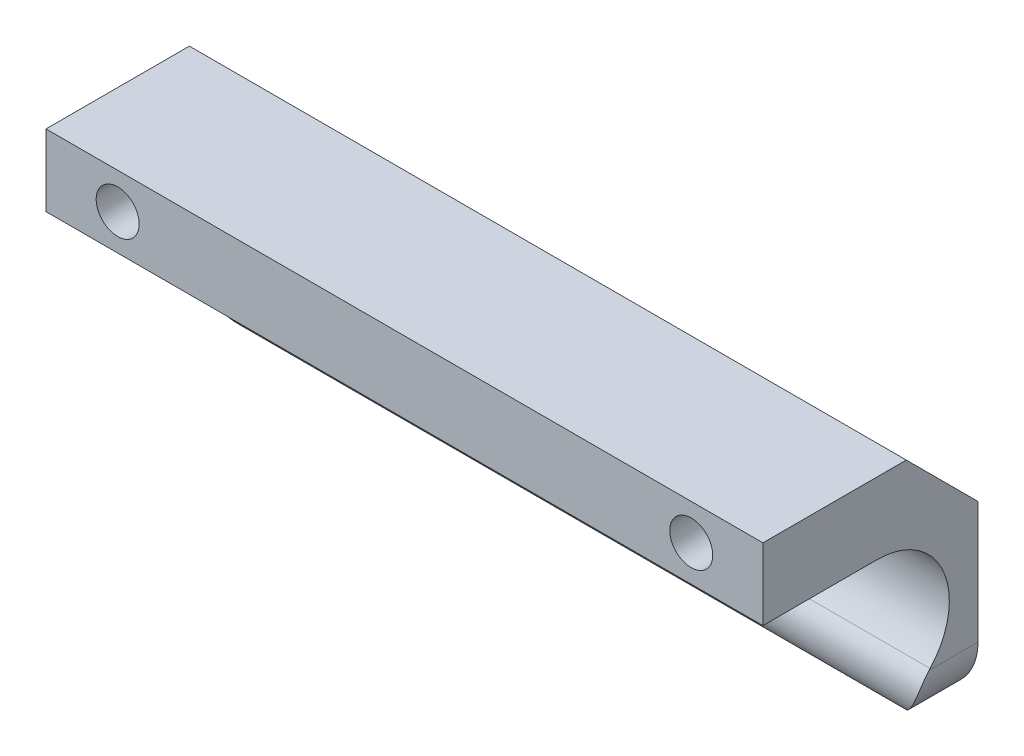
ISO-10303-21;
HEADER;
FILE_DESCRIPTION(('STEP AP214'),'2;1');
FILE_NAME('part.step','',(''),(''),'','','');
FILE_SCHEMA(('AUTOMOTIVE_DESIGN { 1 0 10303 214 1 1 1 1 }'));
ENDSEC;
DATA;
#1=APPLICATION_CONTEXT('core data for automotive mechanical design processes');
#2=APPLICATION_PROTOCOL_DEFINITION('international standard','automotive_design',2000,#1);
#3=PRODUCT_CONTEXT('',#1,'mechanical');
#4=PRODUCT('Part','Part','',(#3));
#5=PRODUCT_RELATED_PRODUCT_CATEGORY('part','',(#4));
#6=PRODUCT_DEFINITION_FORMATION('','',#4);
#7=PRODUCT_DEFINITION_CONTEXT('part definition',#1,'design');
#8=PRODUCT_DEFINITION('design','',#6,#7);
#9=PRODUCT_DEFINITION_SHAPE('','',#8);
#10=(LENGTH_UNIT() NAMED_UNIT(*) SI_UNIT(.MILLI.,.METRE.));
#11=(NAMED_UNIT(*) PLANE_ANGLE_UNIT() SI_UNIT($,.RADIAN.));
#12=(NAMED_UNIT(*) SI_UNIT($,.STERADIAN.) SOLID_ANGLE_UNIT());
#13=UNCERTAINTY_MEASURE_WITH_UNIT(LENGTH_MEASURE(1.E-05),#10,'distance_accuracy_value','');
#14=(GEOMETRIC_REPRESENTATION_CONTEXT(3) GLOBAL_UNCERTAINTY_ASSIGNED_CONTEXT((#13)) GLOBAL_UNIT_ASSIGNED_CONTEXT((#10,
#11,#12)) REPRESENTATION_CONTEXT('',''));
#15=CARTESIAN_POINT('',(0.,0.,0.));
#16=DIRECTION('',(0.,0.,1.));
#17=DIRECTION('',(1.,0.,0.));
#18=AXIS2_PLACEMENT_3D('',#15,#16,#17);
#19=CARTESIAN_POINT('',(-50.,17.5,-15.));
#20=DIRECTION('',(-1.,0.,0.));
#21=DIRECTION('',(0.,0.,1.));
#22=AXIS2_PLACEMENT_3D('',#19,#20,#21);
#23=PLANE('',#22);
#24=DIRECTION('',(0.,1.,0.));
#25=VECTOR('',#24,1.);
#26=CARTESIAN_POINT('',(-50.,-17.5,-15.));
#27=LINE('',#26,#25);
#28=CARTESIAN_POINT('',(-50.,-9.5,-15.));
#29=VERTEX_POINT('',#28);
#30=CARTESIAN_POINT('',(-50.,7.49999999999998,-15.));
#31=VERTEX_POINT('',#30);
#32=EDGE_CURVE('E202',#29,#31,#27,.T.);
#33=ORIENTED_EDGE('',*,*,#32,.F.);
#34=DIRECTION('',(0.,0.,-1.));
#35=VECTOR('',#34,1.);
#36=CARTESIAN_POINT('',(-50.,-9.5,15.));
#37=LINE('',#36,#35);
#38=CARTESIAN_POINT('',(-50.,-9.5,-8.15302564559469));
#39=VERTEX_POINT('',#38);
#40=EDGE_CURVE('E162',#39,#29,#37,.T.);
#41=ORIENTED_EDGE('',*,*,#40,.F.);
#42=CARTESIAN_POINT('',(-50.,-12.642135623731,-11.857864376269));
#43=DIRECTION('',(1.,0.,0.));
#44=DIRECTION('',(0.,0.,-1.));
#45=AXIS2_PLACEMENT_3D('',#42,#43,#44);
#46=CIRCLE('',#45,4.85786437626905);
#47=CARTESIAN_POINT('',(-50.,-9.32610593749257,-8.30782305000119));
#48=VERTEX_POINT('',#47);
#49=EDGE_CURVE('E176',#48,#39,#46,.T.);
#50=ORIENTED_EDGE('',*,*,#49,.F.);
#51=CARTESIAN_POINT('',(-50.,-2.5,-0.999999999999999));
#52=DIRECTION('',(1.,0.,0.));
#53=DIRECTION('',(0.,0.,-1.));
#54=AXIS2_PLACEMENT_3D('',#51,#52,#53);
#55=CIRCLE('',#54,10.);
#56=CARTESIAN_POINT('',(-50.,7.5,-1.));
#57=VERTEX_POINT('',#56);
#58=EDGE_CURVE('E180',#48,#57,#55,.T.);
#59=ORIENTED_EDGE('',*,*,#58,.T.);
#60=DIRECTION('',(0.,0.,1.));
#61=VECTOR('',#60,1.);
#62=CARTESIAN_POINT('',(-50.,7.5,-35.9970345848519));
#63=LINE('',#62,#61);
#64=CARTESIAN_POINT('',(-50.,7.5,15.));
#65=VERTEX_POINT('',#64);
#66=EDGE_CURVE('E185',#57,#65,#63,.T.);
#67=ORIENTED_EDGE('',*,*,#66,.T.);
#68=DIRECTION('',(0.,-1.,0.));
#69=VECTOR('',#68,1.);
#70=CARTESIAN_POINT('',(-50.,-17.5,15.));
#71=LINE('',#70,#69);
#72=CARTESIAN_POINT('',(-50.,17.5,15.));
#73=VERTEX_POINT('',#72);
#74=EDGE_CURVE('E212',#73,#65,#71,.T.);
#75=ORIENTED_EDGE('',*,*,#74,.F.);
#76=DIRECTION('',(0.,0.,1.));
#77=VECTOR('',#76,1.);
#78=CARTESIAN_POINT('',(-50.,17.5,15.));
#79=LINE('',#78,#77);
#80=CARTESIAN_POINT('',(-50.,17.5,-5.));
#81=VERTEX_POINT('',#80);
#82=EDGE_CURVE('E222',#81,#73,#79,.T.);
#83=ORIENTED_EDGE('',*,*,#82,.F.);
#84=DIRECTION('',(0.,0.707106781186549,0.707106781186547));
#85=VECTOR('',#84,1.);
#86=CARTESIAN_POINT('',(-50.,12.5,-9.99999999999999));
#87=LINE('',#86,#85);
#88=EDGE_CURVE('E235',#81,#31,#87,.F.);
#89=ORIENTED_EDGE('',*,*,#88,.T.);
#90=EDGE_LOOP('',(#33,#41,#50,#59,#67,#75,#83,#89));
#91=FACE_BOUND('',#90,.T.);
#92=ADVANCED_FACE('F37',(#91),#23,.T.);
#93=CARTESIAN_POINT('',(50.,17.5,-15.));
#94=DIRECTION('',(-1.,0.,0.));
#95=DIRECTION('',(0.,0.,1.));
#96=AXIS2_PLACEMENT_3D('',#93,#94,#95);
#97=PLANE('',#96);
#98=DIRECTION('',(0.,0.,-1.));
#99=VECTOR('',#98,1.);
#100=CARTESIAN_POINT('',(50.,-9.5,15.));
#101=LINE('',#100,#99);
#102=CARTESIAN_POINT('',(50.,-9.5,-8.15302564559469));
#103=VERTEX_POINT('',#102);
#104=CARTESIAN_POINT('',(50.,-9.5,-15.));
#105=VERTEX_POINT('',#104);
#106=EDGE_CURVE('E168',#103,#105,#101,.T.);
#107=ORIENTED_EDGE('',*,*,#106,.T.);
#108=DIRECTION('',(0.,1.,0.));
#109=VECTOR('',#108,1.);
#110=CARTESIAN_POINT('',(50.,-17.5,-15.));
#111=LINE('',#110,#109);
#112=CARTESIAN_POINT('',(50.,7.49999999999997,-15.));
#113=VERTEX_POINT('',#112);
#114=EDGE_CURVE('E208',#105,#113,#111,.T.);
#115=ORIENTED_EDGE('',*,*,#114,.T.);
#116=DIRECTION('',(0.,-0.707106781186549,-0.707106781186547));
#117=VECTOR('',#116,1.);
#118=CARTESIAN_POINT('',(50.,17.5,-5.));
#119=LINE('',#118,#117);
#120=CARTESIAN_POINT('',(50.,17.5,-5.));
#121=VERTEX_POINT('',#120);
#122=EDGE_CURVE('E243',#113,#121,#119,.F.);
#123=ORIENTED_EDGE('',*,*,#122,.T.);
#124=DIRECTION('',(0.,0.,1.));
#125=VECTOR('',#124,1.);
#126=CARTESIAN_POINT('',(50.,17.5,15.));
#127=LINE('',#126,#125);
#128=CARTESIAN_POINT('',(50.,17.5,15.));
#129=VERTEX_POINT('',#128);
#130=EDGE_CURVE('E211',#121,#129,#127,.T.);
#131=ORIENTED_EDGE('',*,*,#130,.T.);
#132=DIRECTION('',(0.,-1.,0.));
#133=VECTOR('',#132,1.);
#134=CARTESIAN_POINT('',(50.,-17.5,15.));
#135=LINE('',#134,#133);
#136=CARTESIAN_POINT('',(50.,7.5,15.));
#137=VERTEX_POINT('',#136);
#138=EDGE_CURVE('E215',#129,#137,#135,.T.);
#139=ORIENTED_EDGE('',*,*,#138,.T.);
#140=DIRECTION('',(0.,0.,1.));
#141=VECTOR('',#140,1.);
#142=CARTESIAN_POINT('',(50.,7.5,-35.9970345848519));
#143=LINE('',#142,#141);
#144=CARTESIAN_POINT('',(50.,7.5,-1.));
#145=VERTEX_POINT('',#144);
#146=EDGE_CURVE('E181',#145,#137,#143,.T.);
#147=ORIENTED_EDGE('',*,*,#146,.F.);
#148=CARTESIAN_POINT('',(50.,-2.5,-0.999999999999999));
#149=DIRECTION('',(1.,0.,0.));
#150=DIRECTION('',(0.,0.,-1.));
#151=AXIS2_PLACEMENT_3D('',#148,#149,#150);
#152=CIRCLE('',#151,10.);
#153=CARTESIAN_POINT('',(50.,-9.32610593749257,-8.30782305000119));
#154=VERTEX_POINT('',#153);
#155=EDGE_CURVE('E193',#154,#145,#152,.T.);
#156=ORIENTED_EDGE('',*,*,#155,.F.);
#157=CARTESIAN_POINT('',(50.,-12.642135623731,-11.857864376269));
#158=DIRECTION('',(1.,0.,0.));
#159=DIRECTION('',(0.,0.,-1.));
#160=AXIS2_PLACEMENT_3D('',#157,#158,#159);
#161=CIRCLE('',#160,4.85786437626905);
#162=EDGE_CURVE('E175',#154,#103,#161,.T.);
#163=ORIENTED_EDGE('',*,*,#162,.T.);
#164=EDGE_LOOP('',(#107,#115,#123,#131,#139,#147,#156,#163));
#165=FACE_BOUND('',#164,.T.);
#166=ADVANCED_FACE('F267',(#165),#97,.F.);
#167=CARTESIAN_POINT('',(50.,-17.5,-15.));
#168=DIRECTION('',(0.,0.,1.));
#169=DIRECTION('',(1.,0.,0.));
#170=AXIS2_PLACEMENT_3D('',#167,#168,#169);
#171=PLANE('',#170);
#172=DIRECTION('',(1.,0.,0.));
#173=VECTOR('',#172,1.);
#174=CARTESIAN_POINT('',(-50.,-16.3469743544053,-15.));
#175=LINE('',#174,#173);
#176=CARTESIAN_POINT('',(-46.1375043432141,-16.3469743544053,-15.));
#177=VERTEX_POINT('',#176);
#178=CARTESIAN_POINT('',(46.1375043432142,-16.3469743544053,-15.));
#179=VERTEX_POINT('',#178);
#180=EDGE_CURVE('E172',#177,#179,#175,.T.);
#181=ORIENTED_EDGE('',*,*,#180,.F.);
#182=CARTESIAN_POINT('',(-42.,-9.5,-15.));
#183=DIRECTION('',(0.,0.,1.));
#184=DIRECTION('',(-1.,0.,0.));
#185=AXIS2_PLACEMENT_3D('',#182,#183,#184);
#186=CIRCLE('',#185,8.);
#187=EDGE_CURVE('E159',#29,#177,#186,.T.);
#188=ORIENTED_EDGE('',*,*,#187,.F.);
#189=ORIENTED_EDGE('',*,*,#32,.T.);
#190=DIRECTION('',(1.,0.,0.));
#191=VECTOR('',#190,1.);
#192=CARTESIAN_POINT('',(50.,7.49999999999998,-15.));
#193=LINE('',#192,#191);
#194=EDGE_CURVE('E239',#31,#113,#193,.T.);
#195=ORIENTED_EDGE('',*,*,#194,.T.);
#196=ORIENTED_EDGE('',*,*,#114,.F.);
#197=CARTESIAN_POINT('',(42.,-9.5,-15.));
#198=DIRECTION('',(0.,0.,1.));
#199=DIRECTION('',(-1.,0.,0.));
#200=AXIS2_PLACEMENT_3D('',#197,#198,#199);
#201=CIRCLE('',#200,8.00000000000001);
#202=EDGE_CURVE('E165',#179,#105,#201,.T.);
#203=ORIENTED_EDGE('',*,*,#202,.F.);
#204=EDGE_LOOP('',(#181,#188,#189,#195,#196,#203));
#205=FACE_BOUND('',#204,.T.);
#206=ADVANCED_FACE('F314',(#205),#171,.F.);
#207=CARTESIAN_POINT('',(50.,17.5,15.));
#208=DIRECTION('',(0.,-1.,0.));
#209=DIRECTION('',(0.,0.,-1.));
#210=AXIS2_PLACEMENT_3D('',#207,#208,#209);
#211=PLANE('',#210);
#212=ORIENTED_EDGE('',*,*,#130,.F.);
#213=DIRECTION('',(-1.,0.,0.));
#214=VECTOR('',#213,1.);
#215=CARTESIAN_POINT('',(50.,17.5,-5.));
#216=LINE('',#215,#214);
#217=EDGE_CURVE('E231',#121,#81,#216,.T.);
#218=ORIENTED_EDGE('',*,*,#217,.T.);
#219=ORIENTED_EDGE('',*,*,#82,.T.);
#220=DIRECTION('',(-1.,0.,0.));
#221=VECTOR('',#220,1.);
#222=CARTESIAN_POINT('',(50.,17.5,15.));
#223=LINE('',#222,#221);
#224=EDGE_CURVE('E219',#129,#73,#223,.T.);
#225=ORIENTED_EDGE('',*,*,#224,.F.);
#226=EDGE_LOOP('',(#212,#218,#219,#225));
#227=FACE_BOUND('',#226,.T.);
#228=ADVANCED_FACE('F321',(#227),#211,.F.);
#229=CARTESIAN_POINT('',(50.,-17.5,15.));
#230=DIRECTION('',(0.,0.,-1.));
#231=DIRECTION('',(-1.,0.,0.));
#232=AXIS2_PLACEMENT_3D('',#229,#230,#231);
#233=PLANE('',#232);
#234=CARTESIAN_POINT('',(40.,12.5,15.));
#235=DIRECTION('',(0.,0.,1.));
#236=DIRECTION('',(1.,0.,0.));
#237=AXIS2_PLACEMENT_3D('',#234,#235,#236);
#238=CIRCLE('',#237,3.);
#239=CARTESIAN_POINT('',(43.,12.5,15.));
#240=VERTEX_POINT('',#239);
#241=EDGE_CURVE('E490',#240,#240,#238,.T.);
#242=ORIENTED_EDGE('',*,*,#241,.F.);
#243=EDGE_LOOP('',(#242));
#244=FACE_BOUND('',#243,.T.);
#245=CARTESIAN_POINT('',(-40.,12.5,15.));
#246=DIRECTION('',(0.,0.,1.));
#247=DIRECTION('',(1.,0.,0.));
#248=AXIS2_PLACEMENT_3D('',#245,#246,#247);
#249=CIRCLE('',#248,3.);
#250=CARTESIAN_POINT('',(-37.,12.5,15.));
#251=VERTEX_POINT('',#250);
#252=EDGE_CURVE('E134',#251,#251,#249,.T.);
#253=ORIENTED_EDGE('',*,*,#252,.F.);
#254=EDGE_LOOP('',(#253));
#255=FACE_BOUND('',#254,.T.);
#256=ORIENTED_EDGE('',*,*,#74,.T.);
#257=DIRECTION('',(1.,0.,0.));
#258=VECTOR('',#257,1.);
#259=CARTESIAN_POINT('',(-50.,7.5,15.));
#260=LINE('',#259,#258);
#261=EDGE_CURVE('E198',#65,#137,#260,.T.);
#262=ORIENTED_EDGE('',*,*,#261,.T.);
#263=ORIENTED_EDGE('',*,*,#138,.F.);
#264=ORIENTED_EDGE('',*,*,#224,.T.);
#265=EDGE_LOOP('',(#256,#262,#263,#264));
#266=FACE_BOUND('',#265,.T.);
#267=ADVANCED_FACE('F318',(#244,#255,#266),#233,.F.);
#268=CARTESIAN_POINT('',(50.,17.5,-5.));
#269=DIRECTION('',(0.,-0.707106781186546,0.707106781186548));
#270=DIRECTION('',(0.,-0.707106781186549,-0.707106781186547));
#271=AXIS2_PLACEMENT_3D('',#268,#269,#270);
#272=PLANE('',#271);
#273=ORIENTED_EDGE('',*,*,#122,.F.);
#274=ORIENTED_EDGE('',*,*,#194,.F.);
#275=ORIENTED_EDGE('',*,*,#88,.F.);
#276=ORIENTED_EDGE('',*,*,#217,.F.);
#277=EDGE_LOOP('',(#273,#274,#275,#276));
#278=FACE_BOUND('',#277,.T.);
#279=ADVANCED_FACE('F39',(#278),#272,.F.);
#280=CARTESIAN_POINT('',(-50.,-12.642135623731,-11.857864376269));
#281=DIRECTION('',(1.,0.,0.));
#282=DIRECTION('',(0.,0.,-1.));
#283=AXIS2_PLACEMENT_3D('',#280,#281,#282);
#284=CYLINDRICAL_SURFACE('',#283,4.85786437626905);
#285=CARTESIAN_POINT('',(-46.1375043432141,-16.3469743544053,-15.));
#286=CARTESIAN_POINT('',(-46.0261493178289,-16.4142592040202,-14.9206561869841));
#287=CARTESIAN_POINT('',(-45.9139235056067,-16.4783721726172,-14.8399052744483));
#288=CARTESIAN_POINT('',(-45.6879480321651,-16.6003901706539,-14.675935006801));
#289=CARTESIAN_POINT('',(-45.5741986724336,-16.65829640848,-14.5927161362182));
#290=CARTESIAN_POINT('',(-45.231107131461,-16.8228592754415,-14.3399621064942));
#291=CARTESIAN_POINT('',(-44.9997446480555,-16.9204660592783,-14.1672029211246));
#292=CARTESIAN_POINT('',(-44.5341663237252,-17.0920563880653,-13.8161969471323));
#293=CARTESIAN_POINT('',(-44.2999657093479,-17.1661334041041,-13.6379750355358));
#294=CARTESIAN_POINT('',(-43.8289391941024,-17.2919435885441,-13.2772338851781));
#295=CARTESIAN_POINT('',(-43.5921135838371,-17.3436792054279,-13.0947151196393));
#296=CARTESIAN_POINT('',(-43.1319730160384,-17.422727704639,-12.7387085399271));
#297=CARTESIAN_POINT('',(-42.9087578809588,-17.4513858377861,-12.5653856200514));
#298=CARTESIAN_POINT('',(-42.4617109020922,-17.4898128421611,-12.2176471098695));
#299=CARTESIAN_POINT('',(-42.2378795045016,-17.4995929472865,-12.0432322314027));
#300=CARTESIAN_POINT('',(-42.0094068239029,-17.4999958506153,-11.865194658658));
#301=CARTESIAN_POINT('',(-42.00470339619,-17.4999999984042,-11.8615295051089));
#302=CARTESIAN_POINT('',(-42.,-17.5,-11.857864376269));
#303=B_SPLINE_CURVE_WITH_KNOTS('',3,(#285,#286,#287,#288,#289,#290,#291,#292,#293,#294,#295,
#296,#297,#298,#299,#300,#301,#302),.UNSPECIFIED.,.F.,.F.,(4,2,2,2,2,2,2,2,4),(0.,
0.457072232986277,0.914055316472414,1.8272981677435,2.73686646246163,3.64633504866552,
4.49789854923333,5.34895514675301,5.3668436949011),.UNSPECIFIED.);
#304=CARTESIAN_POINT('',(-42.,-17.5,-11.857864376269));
#305=VERTEX_POINT('',#304);
#306=EDGE_CURVE('E11',#177,#305,#303,.T.);
#307=ORIENTED_EDGE('',*,*,#306,.F.);
#308=ORIENTED_EDGE('',*,*,#180,.T.);
#309=CARTESIAN_POINT('',(46.1375043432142,-16.3469743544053,-15.));
#310=CARTESIAN_POINT('',(46.0261493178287,-16.4142592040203,-14.920656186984));
#311=CARTESIAN_POINT('',(45.9139235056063,-16.4783721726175,-14.839905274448));
#312=CARTESIAN_POINT('',(45.6879480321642,-16.6003901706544,-14.6759350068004));
#313=CARTESIAN_POINT('',(45.5741986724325,-16.6582964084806,-14.5927161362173));
#314=CARTESIAN_POINT('',(45.2311071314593,-16.8228592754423,-14.3399621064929));
#315=CARTESIAN_POINT('',(44.9997446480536,-16.9204660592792,-14.1672029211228));
#316=CARTESIAN_POINT('',(44.534166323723,-17.092056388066,-13.8161969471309));
#317=CARTESIAN_POINT('',(44.2999657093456,-17.1661334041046,-13.6379750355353));
#318=CARTESIAN_POINT('',(43.8289391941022,-17.2919435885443,-13.2772338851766));
#319=CARTESIAN_POINT('',(43.5921135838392,-17.343679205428,-13.0947151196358));
#320=CARTESIAN_POINT('',(43.1319730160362,-17.422727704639,-12.7387085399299));
#321=CARTESIAN_POINT('',(42.9087578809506,-17.4513858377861,-12.5653856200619));
#322=CARTESIAN_POINT('',(42.4617109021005,-17.4898128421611,-12.217647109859));
#323=CARTESIAN_POINT('',(42.2378795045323,-17.4995929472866,-12.0432322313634));
#324=CARTESIAN_POINT('',(42.0094068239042,-17.4999958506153,-11.8651946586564));
#325=CARTESIAN_POINT('',(42.0047033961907,-17.4999999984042,-11.8615295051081));
#326=CARTESIAN_POINT('',(42.,-17.5,-11.857864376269));
#327=B_SPLINE_CURVE_WITH_KNOTS('',3,(#309,#310,#311,#312,#313,#314,#315,#316,#317,#318,#319,
#320,#321,#322,#323,#324,#325,#326),.UNSPECIFIED.,.F.,.F.,(4,2,2,2,2,2,2,2,4),(0.,
0.457072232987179,0.914055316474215,1.8272981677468,2.73686646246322,3.6463350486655,
4.49789854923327,5.34895514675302,5.36684369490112),.UNSPECIFIED.);
#328=CARTESIAN_POINT('',(42.,-17.5,-11.857864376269));
#329=VERTEX_POINT('',#328);
#330=EDGE_CURVE('E246',#329,#179,#327,.F.);
#331=ORIENTED_EDGE('',*,*,#330,.F.);
#332=CARTESIAN_POINT('',(50.,-9.5,-8.15302564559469));
#333=CARTESIAN_POINT('',(50.0000097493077,-9.59352523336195,-8.07368202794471));
#334=CARTESIAN_POINT('',(49.9983604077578,-9.69008993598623,-7.99789663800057));
#335=CARTESIAN_POINT('',(49.9911711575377,-9.8885985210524,-7.85388207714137));
#336=CARTESIAN_POINT('',(49.9856301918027,-9.99054385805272,-7.78565496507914));
#337=CARTESIAN_POINT('',(49.9700913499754,-10.198972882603,-7.65729543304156));
#338=CARTESIAN_POINT('',(49.9600973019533,-10.3054526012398,-7.59715611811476));
#339=CARTESIAN_POINT('',(49.9351784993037,-10.52217077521,-7.48528386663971));
#340=CARTESIAN_POINT('',(49.9202543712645,-10.6324087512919,-7.4335498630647));
#341=CARTESIAN_POINT('',(49.8850588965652,-10.8559787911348,-7.33865317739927));
#342=CARTESIAN_POINT('',(49.8647759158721,-10.9693170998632,-7.29550950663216));
#343=CARTESIAN_POINT('',(49.8186122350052,-11.1979113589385,-7.21807659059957));
#344=CARTESIAN_POINT('',(49.7927294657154,-11.3131680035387,-7.1837906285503));
#345=CARTESIAN_POINT('',(49.735281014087,-11.5444077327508,-7.12414698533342));
#346=CARTESIAN_POINT('',(49.703722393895,-11.6603897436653,-7.09877832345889));
#347=CARTESIAN_POINT('',(49.6348944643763,-11.8922834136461,-7.05677505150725));
#348=CARTESIAN_POINT('',(49.5976230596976,-12.0081950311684,-7.04014365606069));
#349=CARTESIAN_POINT('',(49.51821752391,-12.2369330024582,-7.01558661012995));
#350=CARTESIAN_POINT('',(49.4761815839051,-12.34977757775,-7.00751149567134));
#351=CARTESIAN_POINT('',(49.386927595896,-12.5737336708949,-6.99918860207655));
#352=CARTESIAN_POINT('',(49.3397075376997,-12.6848444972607,-6.99894387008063));
#353=CARTESIAN_POINT('',(49.2403552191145,-12.9046752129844,-7.00585245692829));
#354=CARTESIAN_POINT('',(49.188220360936,-13.0133938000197,-7.01300970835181));
#355=CARTESIAN_POINT('',(49.0793844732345,-13.2278389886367,-7.03423365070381));
#356=CARTESIAN_POINT('',(49.0226824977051,-13.3335649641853,-7.04830177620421));
#357=CARTESIAN_POINT('',(48.8837240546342,-13.5793186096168,-7.08909377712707));
#358=CARTESIAN_POINT('',(48.7996590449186,-13.7178767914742,-7.11855734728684));
#359=CARTESIAN_POINT('',(48.6246176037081,-13.9877993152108,-7.1880171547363));
#360=CARTESIAN_POINT('',(48.5336391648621,-14.1191615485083,-7.22801645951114));
#361=CARTESIAN_POINT('',(48.34555598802,-14.3743273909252,-7.31730842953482));
#362=CARTESIAN_POINT('',(48.2484445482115,-14.4981224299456,-7.36661138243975));
#363=CARTESIAN_POINT('',(48.0489770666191,-14.7377664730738,-7.47330173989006));
#364=CARTESIAN_POINT('',(47.9466195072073,-14.8536131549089,-7.53069149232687));
#365=CARTESIAN_POINT('',(47.6981722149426,-15.1191765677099,-7.67530997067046));
#366=CARTESIAN_POINT('',(47.5500680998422,-15.2653178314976,-7.76566141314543));
#367=CARTESIAN_POINT('',(47.2469870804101,-15.5424592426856,-7.95717871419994));
#368=CARTESIAN_POINT('',(47.0920104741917,-15.673460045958,-8.05834410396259));
#369=CARTESIAN_POINT('',(46.7761676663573,-15.920945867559,-8.26972021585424));
#370=CARTESIAN_POINT('',(46.6152908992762,-16.0374030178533,-8.37994765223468));
#371=CARTESIAN_POINT('',(46.2890167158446,-16.2559526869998,-8.60762234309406));
#372=CARTESIAN_POINT('',(46.1236192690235,-16.3580451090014,-8.72506964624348));
#373=CARTESIAN_POINT('',(45.7251962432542,-16.5847491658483,-9.01187498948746));
#374=CARTESIAN_POINT('',(45.4904917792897,-16.7030468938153,-9.18391192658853));
#375=CARTESIAN_POINT('',(45.0159252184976,-16.9142900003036,-9.53627860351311));
#376=CARTESIAN_POINT('',(44.7760611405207,-17.007225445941,-9.71661156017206));
#377=CARTESIAN_POINT('',(44.2929259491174,-17.1685898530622,-10.0830184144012));
#378=CARTESIAN_POINT('',(44.0496584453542,-17.2370429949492,-10.2690864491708));
#379=CARTESIAN_POINT('',(43.5608069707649,-17.3502768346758,-10.6450941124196));
#380=CARTESIAN_POINT('',(43.3152234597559,-17.395062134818,-10.8350329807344));
#381=CARTESIAN_POINT('',(42.7182200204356,-17.4755446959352,-11.2982018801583));
#382=CARTESIAN_POINT('',(42.3660106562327,-17.4993671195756,-11.5726501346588));
#383=CARTESIAN_POINT('',(42.0094067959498,-17.4999958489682,-11.8505341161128));
#384=CARTESIAN_POINT('',(42.0047033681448,-17.4999999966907,-11.854199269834));
#385=CARTESIAN_POINT('',(42.,-17.5,-11.857864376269));
#386=B_SPLINE_CURVE_WITH_KNOTS('',3,(#332,#333,#334,#335,#336,#337,#338,#339,#340,#341,#342,
#343,#344,#345,#346,#347,#348,#349,#350,#351,#352,#353,#354,#355,#356,#357,#358,#359,#360,#361,
#362,#363,#364,#365,#366,#367,#368,#369,#370,#371,#372,#373,#374,#375,#376,#377,#378,#379,#380,
#381,#382,#383,#384,#385),.UNSPECIFIED.,.F.,.F.,(4,2,2,2,2,2,2,2,2,2,2,2,2,2,2,2,2,2,2,2,2,2,2,
2,2,2,4),(0.,0.367866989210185,0.735833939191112,1.10348517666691,1.47108970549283,
1.83949895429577,2.20804456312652,2.57613474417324,2.94436025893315,3.30604174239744,
3.66786397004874,4.02987852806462,4.391968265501,4.88540779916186,5.37899115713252,
5.87312353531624,6.36739967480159,7.04689686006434,7.72636459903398,8.4071149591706,
9.08786990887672,10.0289002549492,10.9702986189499,11.9107646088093,12.8510476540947,
14.189414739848,14.2073032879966),.UNSPECIFIED.);
#387=EDGE_CURVE('E64',#103,#329,#386,.T.);
#388=ORIENTED_EDGE('',*,*,#387,.F.);
#389=ORIENTED_EDGE('',*,*,#162,.F.);
#390=DIRECTION('',(1.,0.,0.));
#391=VECTOR('',#390,1.);
#392=CARTESIAN_POINT('',(-50.,-9.32610593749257,-8.30782305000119));
#393=LINE('',#392,#391);
#394=EDGE_CURVE('E189',#48,#154,#393,.T.);
#395=ORIENTED_EDGE('',*,*,#394,.F.);
#396=ORIENTED_EDGE('',*,*,#49,.T.);
#397=CARTESIAN_POINT('',(-50.,-9.5,-8.15302564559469));
#398=CARTESIAN_POINT('',(-50.0000097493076,-9.59352523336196,-8.07368202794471));
#399=CARTESIAN_POINT('',(-49.9983604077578,-9.69008993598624,-7.99789663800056));
#400=CARTESIAN_POINT('',(-49.9911711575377,-9.88859852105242,-7.85388207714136));
#401=CARTESIAN_POINT('',(-49.9856301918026,-9.99054385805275,-7.78565496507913));
#402=CARTESIAN_POINT('',(-49.9700913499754,-10.198972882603,-7.65729543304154));
#403=CARTESIAN_POINT('',(-49.9600973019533,-10.3054526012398,-7.59715611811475));
#404=CARTESIAN_POINT('',(-49.9351784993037,-10.52217077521,-7.4852838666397));
#405=CARTESIAN_POINT('',(-49.9202543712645,-10.6324087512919,-7.43354986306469));
#406=CARTESIAN_POINT('',(-49.8850588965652,-10.8559787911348,-7.33865317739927));
#407=CARTESIAN_POINT('',(-49.8647759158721,-10.9693170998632,-7.29550950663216));
#408=CARTESIAN_POINT('',(-49.8186122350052,-11.1979113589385,-7.21807659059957));
#409=CARTESIAN_POINT('',(-49.7927294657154,-11.3131680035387,-7.1837906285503));
#410=CARTESIAN_POINT('',(-49.735281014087,-11.5444077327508,-7.12414698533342));
#411=CARTESIAN_POINT('',(-49.703722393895,-11.6603897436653,-7.09877832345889));
#412=CARTESIAN_POINT('',(-49.6348944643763,-11.8922834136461,-7.05677505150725));
#413=CARTESIAN_POINT('',(-49.5976230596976,-12.0081950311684,-7.04014365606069));
#414=CARTESIAN_POINT('',(-49.51821752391,-12.2369330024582,-7.01558661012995));
#415=CARTESIAN_POINT('',(-49.4761815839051,-12.34977757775,-7.00751149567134));
#416=CARTESIAN_POINT('',(-49.386927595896,-12.5737336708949,-6.99918860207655));
#417=CARTESIAN_POINT('',(-49.3397075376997,-12.6848444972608,-6.99894387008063));
#418=CARTESIAN_POINT('',(-49.2403552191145,-12.9046752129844,-7.00585245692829));
#419=CARTESIAN_POINT('',(-49.1882203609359,-13.0133938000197,-7.01300970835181));
#420=CARTESIAN_POINT('',(-49.0793844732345,-13.2278389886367,-7.03423365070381));
#421=CARTESIAN_POINT('',(-49.0226824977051,-13.3335649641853,-7.04830177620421));
#422=CARTESIAN_POINT('',(-48.8837240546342,-13.5793186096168,-7.08909377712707));
#423=CARTESIAN_POINT('',(-48.7996590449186,-13.7178767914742,-7.11855734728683));
#424=CARTESIAN_POINT('',(-48.6246176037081,-13.9877993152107,-7.18801715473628));
#425=CARTESIAN_POINT('',(-48.5336391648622,-14.1191615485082,-7.22801645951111));
#426=CARTESIAN_POINT('',(-48.34555598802,-14.3743273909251,-7.31730842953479));
#427=CARTESIAN_POINT('',(-48.2484445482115,-14.4981224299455,-7.36661138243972));
#428=CARTESIAN_POINT('',(-48.0489770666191,-14.7377664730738,-7.47330173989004));
#429=CARTESIAN_POINT('',(-47.9466195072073,-14.8536131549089,-7.53069149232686));
#430=CARTESIAN_POINT('',(-47.6981722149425,-15.11917656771,-7.67530997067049));
#431=CARTESIAN_POINT('',(-47.5500680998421,-15.2653178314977,-7.76566141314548));
#432=CARTESIAN_POINT('',(-47.2469870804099,-15.5424592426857,-7.95717871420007));
#433=CARTESIAN_POINT('',(-47.0920104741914,-15.6734600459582,-8.05834410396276));
#434=CARTESIAN_POINT('',(-46.776167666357,-15.9209458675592,-8.26972021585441));
#435=CARTESIAN_POINT('',(-46.6152908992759,-16.0374030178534,-8.3799476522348));
#436=CARTESIAN_POINT('',(-46.2890167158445,-16.2559526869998,-8.60762234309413));
#437=CARTESIAN_POINT('',(-46.1236192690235,-16.3580451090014,-8.72506964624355));
#438=CARTESIAN_POINT('',(-45.7251962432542,-16.5847491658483,-9.01187498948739));
#439=CARTESIAN_POINT('',(-45.4904917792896,-16.7030468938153,-9.18391192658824));
#440=CARTESIAN_POINT('',(-45.015925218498,-16.9142900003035,-9.53627860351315));
#441=CARTESIAN_POINT('',(-44.7760611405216,-17.0072254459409,-9.71661156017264));
#442=CARTESIAN_POINT('',(-44.2929259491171,-17.1685898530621,-10.0830184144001));
#443=CARTESIAN_POINT('',(-44.0496584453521,-17.2370429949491,-10.2690864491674));
#444=CARTESIAN_POINT('',(-43.5608069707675,-17.3502768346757,-10.6450941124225));
#445=CARTESIAN_POINT('',(-43.3152234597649,-17.395062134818,-10.8350329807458));
#446=CARTESIAN_POINT('',(-42.7182200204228,-17.4755446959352,-11.298201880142));
#447=CARTESIAN_POINT('',(-42.3660106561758,-17.4993671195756,-11.5726501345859));
#448=CARTESIAN_POINT('',(-42.0094067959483,-17.4999958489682,-11.8505341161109));
#449=CARTESIAN_POINT('',(-42.004703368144,-17.4999999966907,-11.854199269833));
#450=CARTESIAN_POINT('',(-42.,-17.5,-11.857864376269));
#451=B_SPLINE_CURVE_WITH_KNOTS('',3,(#397,#398,#399,#400,#401,#402,#403,#404,#405,#406,#407,
#408,#409,#410,#411,#412,#413,#414,#415,#416,#417,#418,#419,#420,#421,#422,#423,#424,#425,#426,
#427,#428,#429,#430,#431,#432,#433,#434,#435,#436,#437,#438,#439,#440,#441,#442,#443,#444,#445,
#446,#447,#448,#449,#450),.UNSPECIFIED.,.F.,.F.,(4,2,2,2,2,2,2,2,2,2,2,2,2,2,2,2,2,2,2,2,2,2,2,
2,2,2,4),(0.,0.367866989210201,0.735833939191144,1.10348517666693,1.47108970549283,
1.83949895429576,2.20804456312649,2.57613474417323,2.94436025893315,3.30604174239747,
3.66786397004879,4.02987852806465,4.391968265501,4.88540779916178,5.37899115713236,
5.87312353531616,6.36739967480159,7.04689686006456,7.72636459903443,8.40711495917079,
9.08786990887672,10.0289002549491,10.9702986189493,11.910764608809,12.8510476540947,
14.189414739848,14.2073032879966),.UNSPECIFIED.);
#452=EDGE_CURVE('E51',#305,#39,#451,.F.);
#453=ORIENTED_EDGE('',*,*,#452,.F.);
#454=EDGE_LOOP('',(#307,#308,#331,#388,#389,#395,#396,#453));
#455=FACE_BOUND('',#454,.T.);
#456=ADVANCED_FACE('F259',(#455),#284,.T.);
#457=CARTESIAN_POINT('',(-50.,7.5,-35.9970345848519));
#458=DIRECTION('',(0.,1.,0.));
#459=DIRECTION('',(0.,0.,1.));
#460=AXIS2_PLACEMENT_3D('',#457,#458,#459);
#461=PLANE('',#460);
#462=ORIENTED_EDGE('',*,*,#146,.T.);
#463=ORIENTED_EDGE('',*,*,#261,.F.);
#464=ORIENTED_EDGE('',*,*,#66,.F.);
#465=DIRECTION('',(1.,0.,0.));
#466=VECTOR('',#465,1.);
#467=CARTESIAN_POINT('',(-50.,7.5,-1.));
#468=LINE('',#467,#466);
#469=EDGE_CURVE('E203',#57,#145,#468,.T.);
#470=ORIENTED_EDGE('',*,*,#469,.T.);
#471=EDGE_LOOP('',(#462,#463,#464,#470));
#472=FACE_BOUND('',#471,.T.);
#473=ADVANCED_FACE('F264',(#472),#461,.F.);
#474=CARTESIAN_POINT('',(-50.,-2.5,-0.999999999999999));
#475=DIRECTION('',(1.,0.,0.));
#476=DIRECTION('',(0.,0.,-1.));
#477=AXIS2_PLACEMENT_3D('',#474,#475,#476);
#478=CYLINDRICAL_SURFACE('',#477,10.);
#479=ORIENTED_EDGE('',*,*,#155,.T.);
#480=ORIENTED_EDGE('',*,*,#469,.F.);
#481=ORIENTED_EDGE('',*,*,#58,.F.);
#482=ORIENTED_EDGE('',*,*,#394,.T.);
#483=EDGE_LOOP('',(#479,#480,#481,#482));
#484=FACE_BOUND('',#483,.T.);
#485=ADVANCED_FACE('F266',(#484),#478,.F.);
#486=CARTESIAN_POINT('',(42.,-9.5,15.));
#487=DIRECTION('',(0.,0.,-1.));
#488=DIRECTION('',(-1.,0.,0.));
#489=AXIS2_PLACEMENT_3D('',#486,#487,#488);
#490=CYLINDRICAL_SURFACE('',#489,8.00000000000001);
#491=ORIENTED_EDGE('',*,*,#387,.T.);
#492=ORIENTED_EDGE('',*,*,#330,.T.);
#493=ORIENTED_EDGE('',*,*,#202,.T.);
#494=ORIENTED_EDGE('',*,*,#106,.F.);
#495=EDGE_LOOP('',(#491,#492,#493,#494));
#496=FACE_BOUND('',#495,.T.);
#497=ADVANCED_FACE('F256',(#496),#490,.T.);
#498=CARTESIAN_POINT('',(-42.,-9.5,15.));
#499=DIRECTION('',(0.,0.,-1.));
#500=DIRECTION('',(-1.,0.,0.));
#501=AXIS2_PLACEMENT_3D('',#498,#499,#500);
#502=CYLINDRICAL_SURFACE('',#501,8.);
#503=ORIENTED_EDGE('',*,*,#306,.T.);
#504=ORIENTED_EDGE('',*,*,#452,.T.);
#505=ORIENTED_EDGE('',*,*,#40,.T.);
#506=ORIENTED_EDGE('',*,*,#187,.T.);
#507=EDGE_LOOP('',(#503,#504,#505,#506));
#508=FACE_BOUND('',#507,.T.);
#509=ADVANCED_FACE('F276',(#508),#502,.T.);
#510=CARTESIAN_POINT('',(-40.,12.5,-2.));
#511=DIRECTION('',(0.,0.,1.));
#512=DIRECTION('',(1.,0.,0.));
#513=AXIS2_PLACEMENT_3D('',#510,#511,#512);
#514=CONICAL_SURFACE('',#513,2.5,1.02974425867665);
#515=CARTESIAN_POINT('',(-40.,12.5,-3.5021515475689));
#516=VERTEX_POINT('',#515);
#517=VERTEX_LOOP('',#516);
#518=FACE_BOUND('',#517,.T.);
#519=CARTESIAN_POINT('',(-40.,12.5,-2.));
#520=DIRECTION('',(0.,0.,1.));
#521=DIRECTION('',(1.,0.,0.));
#522=AXIS2_PLACEMENT_3D('',#519,#520,#521);
#523=CIRCLE('',#522,2.5);
#524=CARTESIAN_POINT('',(-37.5,12.5,-2.));
#525=VERTEX_POINT('',#524);
#526=EDGE_CURVE('E156',#525,#525,#523,.T.);
#527=ORIENTED_EDGE('',*,*,#526,.T.);
#528=EDGE_LOOP('',(#527));
#529=FACE_BOUND('',#528,.T.);
#530=ADVANCED_FACE('F280',(#518,#529),#514,.F.);
#531=CARTESIAN_POINT('',(-40.,12.5,15.));
#532=DIRECTION('',(0.,0.,1.));
#533=DIRECTION('',(1.,0.,0.));
#534=AXIS2_PLACEMENT_3D('',#531,#532,#533);
#535=CYLINDRICAL_SURFACE('',#534,2.5);
#536=ORIENTED_EDGE('',*,*,#526,.F.);
#537=EDGE_LOOP('',(#536));
#538=FACE_BOUND('',#537,.T.);
#539=CARTESIAN_POINT('',(-40.,12.5,3.));
#540=DIRECTION('',(0.,0.,1.));
#541=DIRECTION('',(1.,0.,0.));
#542=AXIS2_PLACEMENT_3D('',#539,#540,#541);
#543=CIRCLE('',#542,2.5);
#544=CARTESIAN_POINT('',(-37.5,12.5,3.));
#545=VERTEX_POINT('',#544);
#546=EDGE_CURVE('E152',#545,#545,#543,.T.);
#547=ORIENTED_EDGE('',*,*,#546,.T.);
#548=EDGE_LOOP('',(#547));
#549=FACE_BOUND('',#548,.T.);
#550=ADVANCED_FACE('F284',(#538,#549),#535,.F.);
#551=CARTESIAN_POINT('',(-37.5,12.5,3.));
#552=DIRECTION('',(0.,0.,-1.));
#553=DIRECTION('',(-1.,0.,0.));
#554=AXIS2_PLACEMENT_3D('',#551,#552,#553);
#555=PLANE('',#554);
#556=ORIENTED_EDGE('',*,*,#546,.F.);
#557=EDGE_LOOP('',(#556));
#558=FACE_BOUND('',#557,.T.);
#559=CARTESIAN_POINT('',(-40.,12.5,3.));
#560=DIRECTION('',(0.,0.,1.));
#561=DIRECTION('',(1.,0.,0.));
#562=AXIS2_PLACEMENT_3D('',#559,#560,#561);
#563=CIRCLE('',#562,3.);
#564=CARTESIAN_POINT('',(-37.,12.5,3.));
#565=VERTEX_POINT('',#564);
#566=EDGE_CURVE('E141',#565,#565,#563,.T.);
#567=ORIENTED_EDGE('',*,*,#566,.T.);
#568=EDGE_LOOP('',(#567));
#569=FACE_BOUND('',#568,.T.);
#570=ADVANCED_FACE('F288',(#558,#569),#555,.F.);
#571=CARTESIAN_POINT('',(-40.,12.5,15.));
#572=DIRECTION('',(0.,0.,1.));
#573=DIRECTION('',(1.,0.,0.));
#574=AXIS2_PLACEMENT_3D('',#571,#572,#573);
#575=CYLINDRICAL_SURFACE('',#574,3.);
#576=ORIENTED_EDGE('',*,*,#566,.F.);
#577=EDGE_LOOP('',(#576));
#578=FACE_BOUND('',#577,.T.);
#579=ORIENTED_EDGE('',*,*,#252,.T.);
#580=EDGE_LOOP('',(#579));
#581=FACE_BOUND('',#580,.T.);
#582=ADVANCED_FACE('F127',(#578,#581),#575,.F.);
#583=CARTESIAN_POINT('',(40.,12.5,-2.));
#584=DIRECTION('',(0.,0.,1.));
#585=DIRECTION('',(1.,0.,0.));
#586=AXIS2_PLACEMENT_3D('',#583,#584,#585);
#587=CONICAL_SURFACE('',#586,2.5,1.02974425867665);
#588=CARTESIAN_POINT('',(40.,12.5,-3.5021515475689));
#589=VERTEX_POINT('',#588);
#590=VERTEX_LOOP('',#589);
#591=FACE_BOUND('',#590,.T.);
#592=CARTESIAN_POINT('',(40.,12.5,-2.));
#593=DIRECTION('',(0.,0.,1.));
#594=DIRECTION('',(1.,0.,0.));
#595=AXIS2_PLACEMENT_3D('',#592,#593,#594);
#596=CIRCLE('',#595,2.5);
#597=CARTESIAN_POINT('',(42.5,12.5,-2.));
#598=VERTEX_POINT('',#597);
#599=EDGE_CURVE('E131',#598,#598,#596,.T.);
#600=ORIENTED_EDGE('',*,*,#599,.T.);
#601=EDGE_LOOP('',(#600));
#602=FACE_BOUND('',#601,.T.);
#603=ADVANCED_FACE('F123',(#591,#602),#587,.F.);
#604=CARTESIAN_POINT('',(40.,12.5,15.));
#605=DIRECTION('',(0.,0.,1.));
#606=DIRECTION('',(1.,0.,0.));
#607=AXIS2_PLACEMENT_3D('',#604,#605,#606);
#608=CYLINDRICAL_SURFACE('',#607,2.5);
#609=ORIENTED_EDGE('',*,*,#599,.F.);
#610=EDGE_LOOP('',(#609));
#611=FACE_BOUND('',#610,.T.);
#612=CARTESIAN_POINT('',(40.,12.5,3.));
#613=DIRECTION('',(0.,0.,1.));
#614=DIRECTION('',(1.,0.,0.));
#615=AXIS2_PLACEMENT_3D('',#612,#613,#614);
#616=CIRCLE('',#615,2.5);
#617=CARTESIAN_POINT('',(42.5,12.5,3.));
#618=VERTEX_POINT('',#617);
#619=EDGE_CURVE('E135',#618,#618,#616,.T.);
#620=ORIENTED_EDGE('',*,*,#619,.T.);
#621=EDGE_LOOP('',(#620));
#622=FACE_BOUND('',#621,.T.);
#623=ADVANCED_FACE('F126',(#611,#622),#608,.F.);
#624=CARTESIAN_POINT('',(42.5,12.5,3.));
#625=DIRECTION('',(0.,0.,-1.));
#626=DIRECTION('',(-1.,0.,0.));
#627=AXIS2_PLACEMENT_3D('',#624,#625,#626);
#628=PLANE('',#627);
#629=ORIENTED_EDGE('',*,*,#619,.F.);
#630=EDGE_LOOP('',(#629));
#631=FACE_BOUND('',#630,.T.);
#632=CARTESIAN_POINT('',(40.,12.5,3.));
#633=DIRECTION('',(0.,0.,1.));
#634=DIRECTION('',(1.,0.,0.));
#635=AXIS2_PLACEMENT_3D('',#632,#633,#634);
#636=CIRCLE('',#635,3.);
#637=CARTESIAN_POINT('',(43.,12.5,3.));
#638=VERTEX_POINT('',#637);
#639=EDGE_CURVE('E145',#638,#638,#636,.T.);
#640=ORIENTED_EDGE('',*,*,#639,.T.);
#641=EDGE_LOOP('',(#640));
#642=FACE_BOUND('',#641,.T.);
#643=ADVANCED_FACE('F298',(#631,#642),#628,.F.);
#644=CARTESIAN_POINT('',(40.,12.5,15.));
#645=DIRECTION('',(0.,0.,1.));
#646=DIRECTION('',(1.,0.,0.));
#647=AXIS2_PLACEMENT_3D('',#644,#645,#646);
#648=CYLINDRICAL_SURFACE('',#647,3.);
#649=ORIENTED_EDGE('',*,*,#639,.F.);
#650=EDGE_LOOP('',(#649));
#651=FACE_BOUND('',#650,.T.);
#652=ORIENTED_EDGE('',*,*,#241,.T.);
#653=EDGE_LOOP('',(#652));
#654=FACE_BOUND('',#653,.T.);
#655=ADVANCED_FACE('F301',(#651,#654),#648,.F.);
#656=CLOSED_SHELL('',(#92,#166,#206,#228,#267,#279,#456,#473,#485,#497,#509,#530,#550,#570,#582,
#603,#623,#643,#655));
#657=MANIFOLD_SOLID_BREP('B2',#656);
#658=ADVANCED_BREP_SHAPE_REPRESENTATION('',(#18,#657),#14);
#659=SHAPE_DEFINITION_REPRESENTATION(#9,#658);
ENDSEC;
END-ISO-10303-21;
